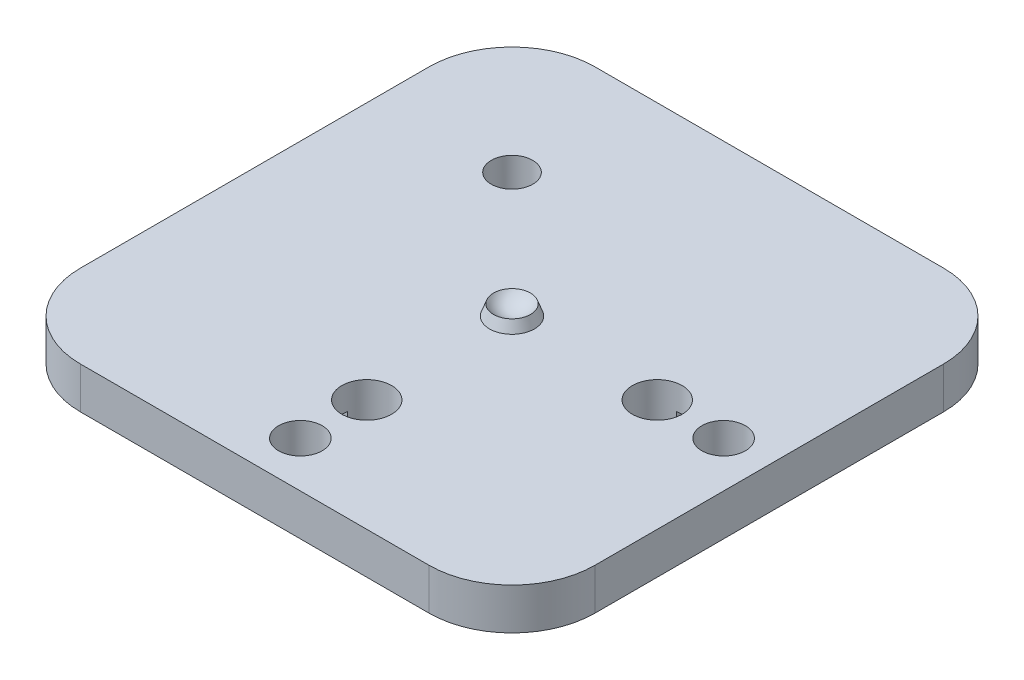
from build123d import *

# Parameters (mm, degrees)
SKETCH4_W           = 62
SKETCH4_H           = 62
SKETCH4_R           = 3
SKETCH4_R_2         = 2.5
SKETCH4_R_3         = 2.625
BOSS_EXTRUDE2_DEPTH = 5
SKETCH5_W           = 10.4
SKETCH5_H           = 1.2
SKETCH5_W_2         = 1.2
SKETCH5_H_2         = 10.4
CUT_EXTRUDE1_DEPTH  = 2
FILLET1_R           = 10


with BuildPart() as part:
    # Sketch3 → Revolve1 (revolve)
    with BuildSketch(Plane.XY, mode=Mode.PRIVATE) as revolve1_sk:
        with BuildLine():
            Line((0, 0), (2.7, 0))
            Line((2.7, 0), (2.233206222, 1.282505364))
            ThreePointArc((2.233206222, 1.282505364), (1.26348021, 0.413869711), (0, 0.1))
            Line((0, 0.1), (0, 0))
        make_face()
    revolve(revolve1_sk.sketch.rotate(Axis((0, 0.1, 0), (0, -1, 0)), 90), axis=Axis((0, 0.1, 0), (0, -1, 0)))

    # Sketch4 → Boss-Extrude2 (add)
    with BuildSketch(Plane.XZ):
        Rectangle(SKETCH4_W, SKETCH4_H)
        with Locations(Location((17.5, 0, 0), (0, 0, 270))):
            Circle(SKETCH4_R, mode=Mode.SUBTRACT)
        with Locations(Location((0, 17.5, 0), (0, 0, 270))):
            Circle(SKETCH4_R, mode=Mode.SUBTRACT)
        with Locations(Location((-15, -15, 0), (0, 0, 270))):
            Circle(SKETCH4_R_2, mode=Mode.SUBTRACT)
        with Locations(Location((0, 25.5, 0), (0, 0, 270))):
            Circle(SKETCH4_R_3, mode=Mode.SUBTRACT)
        with Locations(Location((25.5, 0, 0), (0, 0, 270))):
            Circle(SKETCH4_R_3, mode=Mode.SUBTRACT)
    extrude(amount=BOSS_EXTRUDE2_DEPTH)

    # Sketch5 → Cut-Extrude1 (cut)
    with BuildSketch(Plane.XZ.offset(5)):
        with Locations((0, 17.5)):
            Rectangle(SKETCH5_W, SKETCH5_H)
        with Locations((17.5, 0)):
            Rectangle(SKETCH5_W_2, SKETCH5_H_2)
        Polygon((-18.252691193, -10.898780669), (-10.898780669, -18.252691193), (-11.747308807, -19.101219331), (-19.101219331, -11.747308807), align=None)
    extrude(amount=-CUT_EXTRUDE1_DEPTH, mode=Mode.SUBTRACT)

    # Fillet1
    fillet1_edges = [part.edges().sort_by_distance(p)[0] for p in [
        (31, -2.5, -31),
        (31, -2.5, 31),
        (-31, -2.5, 31),
        (-31, -2.5, -31),
    ]]
    fillet(fillet1_edges, radius=FILLET1_R)


solid = part.part
